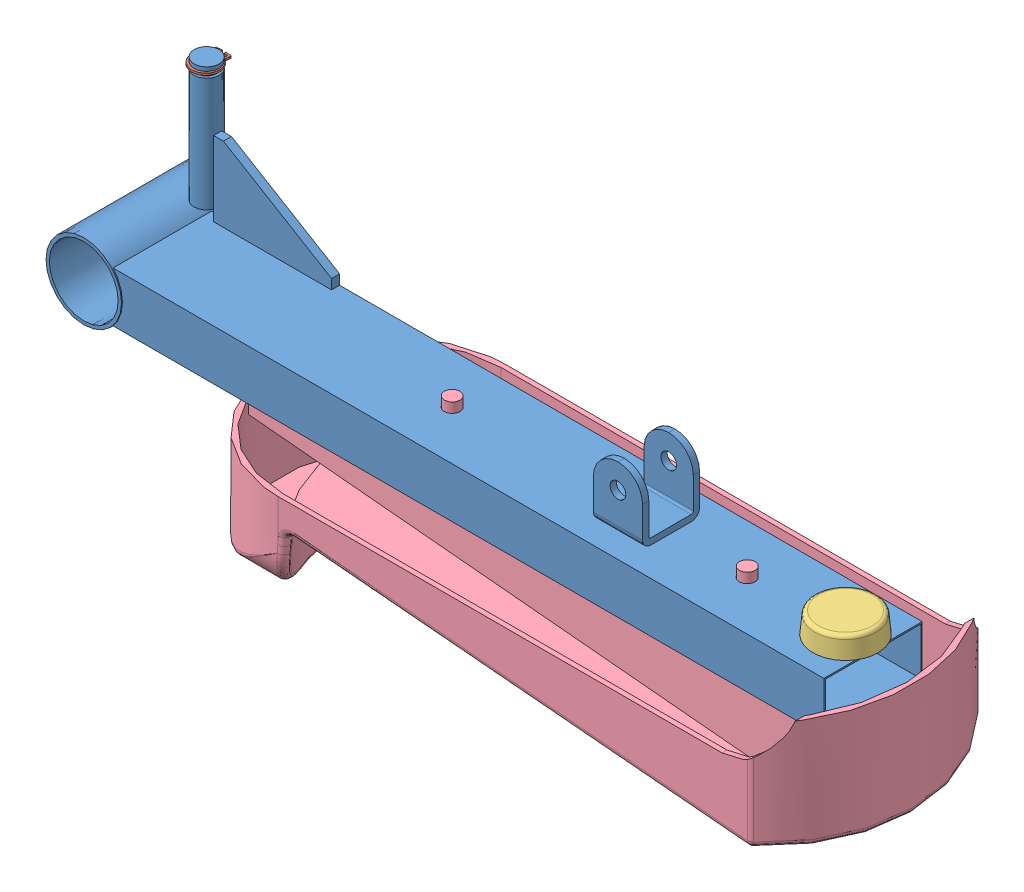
SolidWorks assembly Ensemble_pédale droite.SLDASM, configuration Défaut (file format 14000). Lengths in mm.
Overall size (411.82 146.67 117.89).
4 component instances, 4 part files, 6 mates.
Components (placement in the parent):
- Support_droite-1: Support_droite.SLDPRT [Défaut] at (-177.739 -19.7411 -37.15) size (395 99.95 74.3)
- DIN_RETEXT_12 x 1_1-1: DIN_RETEXT_12 x 1_1.SLDPRT [Défaut] at (-164.589 59.0089 -12.15) x (1 0 0) z (0 -1 0) size (14.14 16.55 1)
- Amortisseur_17-1: Amortisseur_17.SLDPRT [Défaut] at (184.061 -7.4911 11.65) x (0 -1 0) z (0 0 1) size (20 33 33)
- Repose_pied-1: Repose_pied.SLDPRT [Défaut] at (-20.4175 -15.4911 51.8163) x (-1 0 0) z (0 -1 0) size (322.56 117.89 83.67)
Mates (geometry in assembly coordinates):
- Coaxial4: concentric anti-aligned: cylinder of Support_droite-1 through (-164.589 59.0089 -12.15) axis (0 -1 0) radius 5; cylinder of DIN_RETEXT_12 x 1_1-1 through (-164.589 58.0089 -12.15) axis (0 1 0) radius 5.75
- Coïncidente6: coincident anti-aligned: plane of Support_droite-1 through (-164.589 59.0089 -12.15) normal (0 -1 0); plane of DIN_RETEXT_12 x 1_1-1
- Coaxial6: concentric anti-aligned: cylinder of Support_droite-1 through (184.061 -38.9421 11.65) axis (0 1 0) radius 5.2; cylinder of Amortisseur_17-1 through (184.061 -64.4911 11.65) axis (0 -1 0) radius 4
- Coïncidente10: coincident anti-aligned: plane of Support_droite-1 through (-196.94 -32.4911 -13.35) normal (0 -1 0); plane of Repose_pied-1 through (-100.5839 -32.4911 29.3163) normal (0 1 0)
- Coaxiale2: concentric aligned: cylinder of Support_droite-1 through (-15.939 -38.9421 11.65) axis (0 1 0) radius 4; cylinder of Repose_pied-1 through (-15.939 -74.6676 11.65) axis (0 1 0) radius 4
- Coaxiale3: concentric aligned: cylinder of Support_droite-1 through (134.061 -38.9421 11.65) axis (0 1 0) radius 4; cylinder of Repose_pied-1 through (134.061 -74.6676 11.65) axis (0 1 0) radius 4
